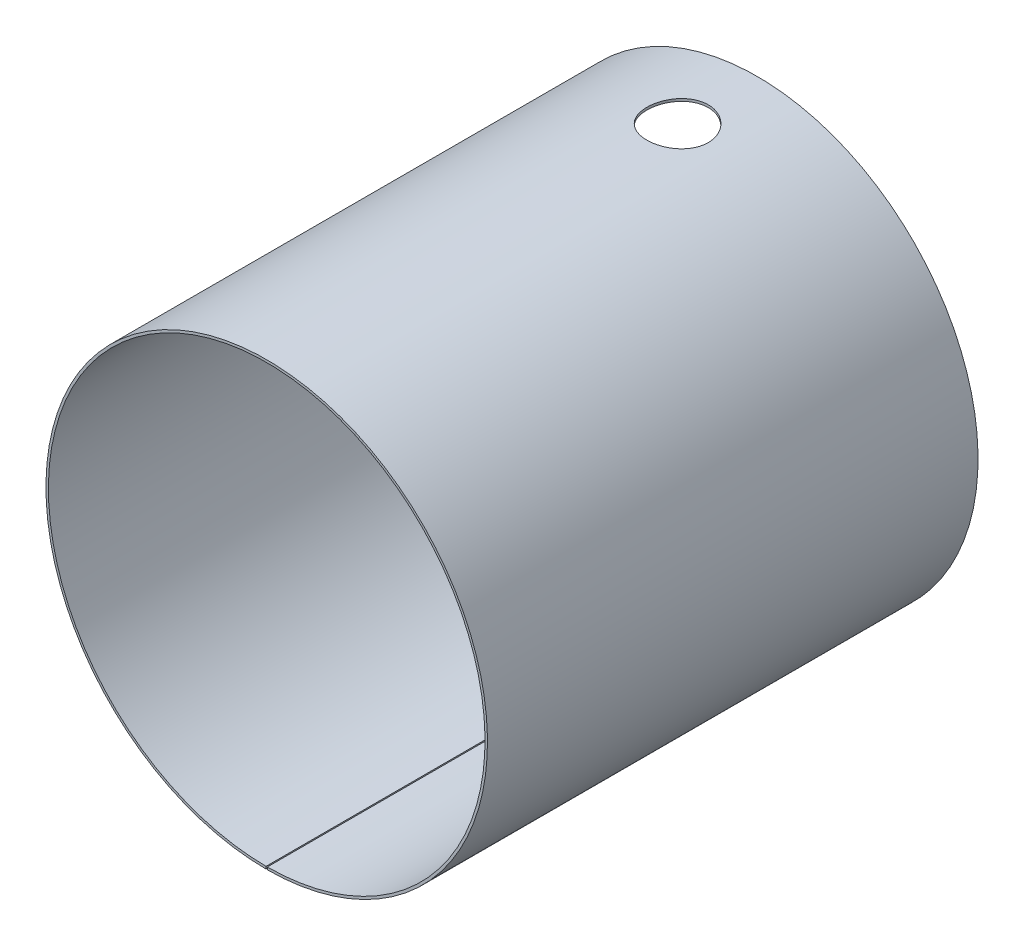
ISO-10303-21;
HEADER;
FILE_DESCRIPTION(('STEP AP214'),'2;1');
FILE_NAME('part.step','',(''),(''),'','','');
FILE_SCHEMA(('AUTOMOTIVE_DESIGN { 1 0 10303 214 1 1 1 1 }'));
ENDSEC;
DATA;
#1=APPLICATION_CONTEXT('core data for automotive mechanical design processes');
#2=APPLICATION_PROTOCOL_DEFINITION('international standard','automotive_design',2000,#1);
#3=PRODUCT_CONTEXT('',#1,'mechanical');
#4=PRODUCT('Part','Part','',(#3));
#5=PRODUCT_RELATED_PRODUCT_CATEGORY('part','',(#4));
#6=PRODUCT_DEFINITION_FORMATION('','',#4);
#7=PRODUCT_DEFINITION_CONTEXT('part definition',#1,'design');
#8=PRODUCT_DEFINITION('design','',#6,#7);
#9=PRODUCT_DEFINITION_SHAPE('','',#8);
#10=(LENGTH_UNIT() NAMED_UNIT(*) SI_UNIT(.MILLI.,.METRE.));
#11=(NAMED_UNIT(*) PLANE_ANGLE_UNIT() SI_UNIT($,.RADIAN.));
#12=(NAMED_UNIT(*) SI_UNIT($,.STERADIAN.) SOLID_ANGLE_UNIT());
#13=UNCERTAINTY_MEASURE_WITH_UNIT(LENGTH_MEASURE(1.E-05),#10,'distance_accuracy_value','');
#14=(GEOMETRIC_REPRESENTATION_CONTEXT(3) GLOBAL_UNCERTAINTY_ASSIGNED_CONTEXT((#13)) GLOBAL_UNIT_ASSIGNED_CONTEXT((#10,
#11,#12)) REPRESENTATION_CONTEXT('',''));
#15=CARTESIAN_POINT('',(0.,0.,0.));
#16=DIRECTION('',(0.,0.,1.));
#17=DIRECTION('',(1.,0.,0.));
#18=AXIS2_PLACEMENT_3D('',#15,#16,#17);
#19=CARTESIAN_POINT('',(0.,0.,400.));
#20=DIRECTION('',(0.,0.,-1.));
#21=DIRECTION('',(-1.,0.,0.));
#22=AXIS2_PLACEMENT_3D('',#19,#20,#21);
#23=CYLINDRICAL_SURFACE('',#22,180.);
#24=CARTESIAN_POINT('',(0.,0.,0.));
#25=DIRECTION('',(0.,0.,1.));
#26=DIRECTION('',(1.,0.,0.));
#27=AXIS2_PLACEMENT_3D('',#24,#25,#26);
#28=CIRCLE('',#27,180.);
#29=CARTESIAN_POINT('',(0.500000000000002,-179.999305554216,0.));
#30=VERTEX_POINT('',#29);
#31=CARTESIAN_POINT('',(-0.500000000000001,-179.999305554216,0.));
#32=VERTEX_POINT('',#31);
#33=EDGE_CURVE('E97',#30,#32,#28,.T.);
#34=ORIENTED_EDGE('',*,*,#33,.T.);
#35=DIRECTION('',(0.,0.,-1.));
#36=VECTOR('',#35,1.);
#37=CARTESIAN_POINT('',(-0.499999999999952,-179.999305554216,400.));
#38=LINE('',#37,#36);
#39=CARTESIAN_POINT('',(-0.499999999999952,-179.999305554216,400.));
#40=VERTEX_POINT('',#39);
#41=EDGE_CURVE('E69',#32,#40,#38,.F.);
#42=ORIENTED_EDGE('',*,*,#41,.T.);
#43=CARTESIAN_POINT('',(0.,0.,400.));
#44=DIRECTION('',(0.,0.,1.));
#45=DIRECTION('',(1.,0.,0.));
#46=AXIS2_PLACEMENT_3D('',#43,#44,#45);
#47=CIRCLE('',#46,180.);
#48=CARTESIAN_POINT('',(0.500000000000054,-179.999305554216,400.));
#49=VERTEX_POINT('',#48);
#50=EDGE_CURVE('E92',#49,#40,#47,.T.);
#51=ORIENTED_EDGE('',*,*,#50,.F.);
#52=DIRECTION('',(0.,0.,-1.));
#53=VECTOR('',#52,1.);
#54=CARTESIAN_POINT('',(0.500000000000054,-179.999305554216,400.));
#55=LINE('',#54,#53);
#56=EDGE_CURVE('E85',#49,#30,#55,.T.);
#57=ORIENTED_EDGE('',*,*,#56,.T.);
#58=EDGE_LOOP('',(#34,#42,#51,#57));
#59=FACE_BOUND('',#58,.T.);
#60=CARTESIAN_POINT('',(0.,180.,40.));
#61=CARTESIAN_POINT('',(-0.69876775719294,180.000003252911,39.9999911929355));
#62=CARTESIAN_POINT('',(-1.39740938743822,179.995923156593,40.0293066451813));
#63=CARTESIAN_POINT('',(-2.78990965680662,179.979723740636,40.1463382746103));
#64=CARTESIAN_POINT('',(-3.48376721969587,179.967602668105,40.2340671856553));
#65=CARTESIAN_POINT('',(-4.8621408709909,179.935642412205,40.4673951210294));
#66=CARTESIAN_POINT('',(-5.54664776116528,179.915796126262,40.6130474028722));
#67=CARTESIAN_POINT('',(-6.90078477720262,179.868947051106,40.9611183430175));
#68=CARTESIAN_POINT('',(-7.57041570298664,179.84194464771,41.1635339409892));
#69=CARTESIAN_POINT('',(-8.88964283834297,179.781561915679,41.6234755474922));
#70=CARTESIAN_POINT('',(-9.53925284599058,179.74818609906,41.8809625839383));
#71=CARTESIAN_POINT('',(-10.8144050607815,179.675976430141,42.4492595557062));
#72=CARTESIAN_POINT('',(-11.4399469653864,179.63714250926,42.7600701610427));
#73=CARTESIAN_POINT('',(-12.6625194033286,179.555105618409,43.4327259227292));
#74=CARTESIAN_POINT('',(-13.2595547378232,179.511903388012,43.794562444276));
#75=CARTESIAN_POINT('',(-14.421123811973,179.42232461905,44.5667531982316));
#76=CARTESIAN_POINT('',(-14.9856574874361,179.375948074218,44.9771075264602));
#77=CARTESIAN_POINT('',(-16.0816542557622,179.28102195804,45.8460860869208));
#78=CARTESIAN_POINT('',(-16.6128975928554,179.232460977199,46.3049862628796));
#79=CARTESIAN_POINT('',(-17.634903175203,179.134792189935,47.2657927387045));
#80=CARTESIAN_POINT('',(-18.1256652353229,179.085684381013,47.7676992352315));
#81=CARTESIAN_POINT('',(-19.0633238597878,178.988301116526,48.8110636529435));
#82=CARTESIAN_POINT('',(-19.5102180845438,178.940025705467,49.352523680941));
#83=CARTESIAN_POINT('',(-20.3569839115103,178.845673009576,50.4712239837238));
#84=CARTESIAN_POINT('',(-20.7568554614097,178.79959572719,51.0484642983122));
#85=CARTESIAN_POINT('',(-21.5083244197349,178.710760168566,52.2372215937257));
#86=CARTESIAN_POINT('',(-21.859711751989,178.668016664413,52.8488725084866));
#87=CARTESIAN_POINT('',(-22.5096715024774,178.587295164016,54.09992731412));
#88=CARTESIAN_POINT('',(-22.8082437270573,178.549317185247,54.7393313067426));
#89=CARTESIAN_POINT('',(-23.3503679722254,178.479228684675,56.041340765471));
#90=CARTESIAN_POINT('',(-23.5939219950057,178.447117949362,56.7039453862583));
#91=CARTESIAN_POINT('',(-24.0242040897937,178.389699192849,58.0476426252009));
#92=CARTESIAN_POINT('',(-24.2109325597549,178.36439112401,58.7287351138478));
#93=CARTESIAN_POINT('',(-24.5251366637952,178.321458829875,60.1000708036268));
#94=CARTESIAN_POINT('',(-24.6529859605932,178.303786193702,60.7902268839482));
#95=CARTESIAN_POINT('',(-24.8502282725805,178.276403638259,62.1789992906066));
#96=CARTESIAN_POINT('',(-24.9196215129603,178.266693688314,62.8776155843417));
#97=CARTESIAN_POINT('',(-24.9994216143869,178.25552039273,64.2782442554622));
#98=CARTESIAN_POINT('',(-25.0098310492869,178.254056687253,64.9802564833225));
#99=CARTESIAN_POINT('',(-24.9715907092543,178.259417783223,66.382637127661));
#100=CARTESIAN_POINT('',(-24.9229411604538,178.266242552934,67.0830055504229));
#101=CARTESIAN_POINT('',(-24.7675089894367,178.287903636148,68.4720991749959));
#102=CARTESIAN_POINT('',(-24.6611411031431,178.302682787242,69.1608717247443));
#103=CARTESIAN_POINT('',(-24.3913447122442,178.339790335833,70.5269368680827));
#104=CARTESIAN_POINT('',(-24.2279165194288,178.362118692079,71.2042295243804));
#105=CARTESIAN_POINT('',(-23.8452057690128,178.413686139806,72.5425851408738));
#106=CARTESIAN_POINT('',(-23.6259222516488,178.442925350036,73.2036478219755));
#107=CARTESIAN_POINT('',(-23.1331033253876,178.5074823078,74.5049243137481));
#108=CARTESIAN_POINT('',(-22.8595676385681,178.542800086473,75.1451380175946));
#109=CARTESIAN_POINT('',(-22.259197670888,178.61864382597,76.4024145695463));
#110=CARTESIAN_POINT('',(-21.9321861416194,178.659187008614,77.019391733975));
#111=CARTESIAN_POINT('',(-21.2278574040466,178.744241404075,78.2236398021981));
#112=CARTESIAN_POINT('',(-20.8505401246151,178.788752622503,78.8109106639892));
#113=CARTESIAN_POINT('',(-20.0482326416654,178.880494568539,79.9517454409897));
#114=CARTESIAN_POINT('',(-19.6232401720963,178.927725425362,80.5053077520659));
#115=CARTESIAN_POINT('',(-18.728546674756,179.023584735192,81.574911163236));
#116=CARTESIAN_POINT('',(-18.2588453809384,179.072213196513,82.090952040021));
#117=CARTESIAN_POINT('',(-17.2737612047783,179.16993101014,83.0862267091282));
#118=CARTESIAN_POINT('',(-16.758021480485,179.219020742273,83.5651073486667));
#119=CARTESIAN_POINT('',(-15.6879407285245,179.315858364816,84.4777571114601));
#120=CARTESIAN_POINT('',(-15.1335994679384,179.363606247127,84.9115259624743));
#121=CARTESIAN_POINT('',(-13.9901695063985,179.456412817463,85.7308912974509));
#122=CARTESIAN_POINT('',(-13.4010805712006,179.501471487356,86.1164874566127));
#123=CARTESIAN_POINT('',(-12.1922707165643,179.587626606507,86.8367472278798));
#124=CARTESIAN_POINT('',(-11.5725498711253,179.628723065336,87.171410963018));
#125=CARTESIAN_POINT('',(-10.3065241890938,179.705809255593,87.7875271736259));
#126=CARTESIAN_POINT('',(-9.66020687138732,179.741796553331,88.0689543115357));
#127=CARTESIAN_POINT('',(-8.34584147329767,179.807618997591,88.5763265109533));
#128=CARTESIAN_POINT('',(-7.67779336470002,179.837454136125,88.8022715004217));
#129=CARTESIAN_POINT('',(-6.32477444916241,179.89012069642,89.1969794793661));
#130=CARTESIAN_POINT('',(-5.63980444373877,179.912952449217,89.3657451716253));
#131=CARTESIAN_POINT('',(-4.25785107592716,179.950961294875,89.6448293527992));
#132=CARTESIAN_POINT('',(-3.56086780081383,179.966138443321,89.7551482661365));
#133=CARTESIAN_POINT('',(-2.16570841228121,179.988311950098,89.9158327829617));
#134=CARTESIAN_POINT('',(-1.46758923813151,179.995374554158,89.9666839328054));
#135=CARTESIAN_POINT('',(-0.0695122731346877,180.00134392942,90.0096836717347));
#136=CARTESIAN_POINT('',(0.630445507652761,180.000250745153,90.0018325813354));
#137=CARTESIAN_POINT('',(2.02716062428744,179.989939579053,89.927488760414));
#138=CARTESIAN_POINT('',(2.72391804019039,179.980721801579,89.8609975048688));
#139=CARTESIAN_POINT('',(4.10926142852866,179.954421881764,89.6698783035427));
#140=CARTESIAN_POINT('',(4.79784740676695,179.937339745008,89.5452503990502));
#141=CARTESIAN_POINT('',(6.15913296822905,179.895877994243,89.2394253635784));
#142=CARTESIAN_POINT('',(6.83188623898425,179.871528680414,89.0584629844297));
#143=CARTESIAN_POINT('',(8.15969958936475,179.816186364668,88.6411424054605));
#144=CARTESIAN_POINT('',(8.81475973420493,179.785193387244,88.4047844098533));
#145=CARTESIAN_POINT('',(10.1026520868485,179.717423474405,87.8783824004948));
#146=CARTESIAN_POINT('',(10.7354835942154,179.680646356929,87.5883366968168));
#147=CARTESIAN_POINT('',(11.9745359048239,179.602327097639,86.9566407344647));
#148=CARTESIAN_POINT('',(12.5807565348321,179.560784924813,86.6149901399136));
#149=CARTESIAN_POINT('',(13.766158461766,179.47380962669,85.8801871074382));
#150=CARTESIAN_POINT('',(14.3451454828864,179.428353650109,85.4867239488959));
#151=CARTESIAN_POINT('',(15.4679780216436,179.335047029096,84.6527537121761));
#152=CARTESIAN_POINT('',(16.0118234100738,179.287196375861,84.2122464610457));
#153=CARTESIAN_POINT('',(17.0606547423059,179.190433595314,83.2872360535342));
#154=CARTESIAN_POINT('',(17.5656389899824,179.141521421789,82.8027309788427));
#155=CARTESIAN_POINT('',(18.5332430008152,179.044004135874,81.7930884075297));
#156=CARTESIAN_POINT('',(18.9958625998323,178.995399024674,81.2679507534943));
#157=CARTESIAN_POINT('',(19.8786513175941,178.899518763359,80.1767974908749));
#158=CARTESIAN_POINT('',(20.2984961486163,178.852255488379,79.6105184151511));
#159=CARTESIAN_POINT('',(21.0889848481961,178.760770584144,78.4443638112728));
#160=CARTESIAN_POINT('',(21.4596284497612,178.716548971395,77.8444881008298));
#161=CARTESIAN_POINT('',(22.1490415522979,178.632417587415,76.6153545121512));
#162=CARTESIAN_POINT('',(22.467811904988,178.59250774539,75.9860971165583));
#163=CARTESIAN_POINT('',(23.0511565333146,178.518152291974,74.7026319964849));
#164=CARTESIAN_POINT('',(23.3157310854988,178.483706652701,74.0484243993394));
#165=CARTESIAN_POINT('',(23.7879819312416,178.421379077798,72.7217939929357));
#166=CARTESIAN_POINT('',(23.9958338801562,178.393476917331,72.0494346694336));
#167=CARTESIAN_POINT('',(24.3541773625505,178.344909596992,70.6893412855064));
#168=CARTESIAN_POINT('',(24.5046689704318,178.324244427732,70.0016072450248));
#169=CARTESIAN_POINT('',(24.7471454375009,178.290756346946,68.6157460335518));
#170=CARTESIAN_POINT('',(24.8391331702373,178.277933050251,67.917619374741));
#171=CARTESIAN_POINT('',(24.9639095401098,178.260503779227,66.5159950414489));
#172=CARTESIAN_POINT('',(24.9966985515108,178.255897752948,65.812497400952));
#173=CARTESIAN_POINT('',(25.0028009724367,178.255041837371,64.4112967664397));
#174=CARTESIAN_POINT('',(24.9766235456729,178.258720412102,63.7135959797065));
#175=CARTESIAN_POINT('',(24.8660367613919,178.274180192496,62.3229189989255));
#176=CARTESIAN_POINT('',(24.7816277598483,178.285961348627,61.6299427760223));
#177=CARTESIAN_POINT('',(24.5552134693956,178.317286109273,60.25364807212));
#178=CARTESIAN_POINT('',(24.4132084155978,178.336829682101,59.5703295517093));
#179=CARTESIAN_POINT('',(24.0726606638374,178.383117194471,58.2181799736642));
#180=CARTESIAN_POINT('',(23.8741178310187,178.409861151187,57.5493489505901));
#181=CARTESIAN_POINT('',(23.4220847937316,178.469767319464,56.231242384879));
#182=CARTESIAN_POINT('',(23.168625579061,178.502925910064,55.5819560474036));
#183=CARTESIAN_POINT('',(22.6085330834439,178.574729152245,54.3070582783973));
#184=CARTESIAN_POINT('',(22.3018998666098,178.613373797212,53.6814468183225));
#185=CARTESIAN_POINT('',(21.6376437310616,178.695059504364,52.4581988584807));
#186=CARTESIAN_POINT('',(21.2800200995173,178.738100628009,51.8605627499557));
#187=CARTESIAN_POINT('',(20.5163006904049,178.827372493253,50.6973606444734));
#188=CARTESIAN_POINT('',(20.1102046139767,178.873603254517,50.1317948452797));
#189=CARTESIAN_POINT('',(19.2488165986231,178.968355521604,49.0320659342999));
#190=CARTESIAN_POINT('',(18.7931464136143,179.016892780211,48.4982004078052));
#191=CARTESIAN_POINT('',(17.8385739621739,179.114531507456,47.4706805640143));
#192=CARTESIAN_POINT('',(17.3396713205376,179.163632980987,46.977026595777));
#193=CARTESIAN_POINT('',(16.3019724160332,179.261031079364,46.0332477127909));
#194=CARTESIAN_POINT('',(15.7631666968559,179.309327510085,45.5831331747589));
#195=CARTESIAN_POINT('',(14.6495039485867,179.403746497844,44.7297220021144));
#196=CARTESIAN_POINT('',(14.0746473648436,179.449869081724,44.3264247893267));
#197=CARTESIAN_POINT('',(12.8900888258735,179.53885359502,43.5677203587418));
#198=CARTESIAN_POINT('',(12.2802362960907,179.58169924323,43.212546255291));
#199=CARTESIAN_POINT('',(11.0324120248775,179.662675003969,42.5548817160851));
#200=CARTESIAN_POINT('',(10.3944386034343,179.700804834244,42.2523944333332));
#201=CARTESIAN_POINT('',(9.09553523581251,179.771225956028,41.702617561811));
#202=CARTESIAN_POINT('',(8.43462819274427,179.803522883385,41.4552746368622));
#203=CARTESIAN_POINT('',(7.0942256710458,179.861397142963,41.0173154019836));
#204=CARTESIAN_POINT('',(6.41473449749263,179.886976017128,40.8266860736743));
#205=CARTESIAN_POINT('',(4.79097719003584,179.938668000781,40.4444928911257));
#206=CARTESIAN_POINT('',(3.84059809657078,179.961567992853,40.2779873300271));
#207=CARTESIAN_POINT('',(1.92673269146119,179.992231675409,40.0557475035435));
#208=CARTESIAN_POINT('',(0.963246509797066,179.999995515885,40.0000121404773));
#209=CARTESIAN_POINT('',(0.,180.,40.));
#210=B_SPLINE_CURVE_WITH_KNOTS('',3,(#60,#61,#62,#63,#64,#65,#66,#67,#68,#69,#70,#71,#72,#73,
#74,#75,#76,#77,#78,#79,#80,#81,#82,#83,#84,#85,#86,#87,#88,#89,#90,#91,#92,#93,#94,#95,#96,#97,
#98,#99,#100,#101,#102,#103,#104,#105,#106,#107,#108,#109,#110,#111,#112,#113,#114,#115,#116,
#117,#118,#119,#120,#121,#122,#123,#124,#125,#126,#127,#128,#129,#130,#131,#132,#133,#134,#135,
#136,#137,#138,#139,#140,#141,#142,#143,#144,#145,#146,#147,#148,#149,#150,#151,#152,#153,#154,
#155,#156,#157,#158,#159,#160,#161,#162,#163,#164,#165,#166,#167,#168,#169,#170,#171,#172,#173,
#174,#175,#176,#177,#178,#179,#180,#181,#182,#183,#184,#185,#186,#187,#188,#189,#190,#191,#192,
#193,#194,#195,#196,#197,#198,#199,#200,#201,#202,#203,#204,#205,#206,#207,#208,#209),
.UNSPECIFIED.,.T.,.F.,(4,2,2,2,2,2,2,2,2,2,2,2,2,2,2,2,2,2,2,2,2,2,2,2,2,2,2,2,2,2,2,2,2,2,2,2,
2,2,2,2,2,2,2,2,2,2,2,2,2,2,2,2,2,2,2,2,2,2,2,2,2,2,2,2,2,2,2,2,2,2,2,2,2,2,4),(0.,
2.09545991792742,4.19137678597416,6.28922521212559,8.38696055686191,10.4832162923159,
12.5794983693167,14.6754261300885,16.7713580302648,18.8799185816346,20.9884887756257,
23.0971713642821,25.2058562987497,27.3234087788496,29.440969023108,31.558452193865,
33.6759205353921,35.779759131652,37.8835896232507,39.9873283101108,42.0910589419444,
44.1798695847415,46.2686688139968,48.3575039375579,50.4463497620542,52.5422649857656,
54.6381831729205,56.7342010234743,58.8302313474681,60.9442161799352,63.0582137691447,
65.1722256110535,67.286232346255,69.4012427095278,71.516255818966,73.6311689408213,
75.7460667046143,77.843573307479,79.9410684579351,82.0385108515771,84.1359517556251,
86.2247668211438,88.3135741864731,90.4024473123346,92.4913340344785,94.5933727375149,
96.6954191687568,98.7975572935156,100.899703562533,103.016756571,105.133821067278,
107.250850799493,109.367869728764,111.478256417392,113.588640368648,115.698920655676,
117.80918760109,119.901302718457,121.99340504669,124.085498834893,126.177597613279,
128.268518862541,130.359437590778,132.450385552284,134.541346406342,136.649558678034,
138.75778924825,140.866521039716,142.975226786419,145.093807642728,147.212515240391,
149.32916462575,151.445327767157,154.333933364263,157.222510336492),.UNSPECIFIED.);
#211=CARTESIAN_POINT('',(0.,180.,40.));
#212=VERTEX_POINT('',#211);
#213=EDGE_CURVE('E122',#212,#212,#210,.T.);
#214=ORIENTED_EDGE('',*,*,#213,.F.);
#215=EDGE_LOOP('',(#214));
#216=FACE_BOUND('',#215,.T.);
#217=ADVANCED_FACE('F45',(#59,#216),#23,.T.);
#218=CARTESIAN_POINT('',(0.,0.,400.));
#219=DIRECTION('',(0.,0.,-1.));
#220=DIRECTION('',(-1.,0.,0.));
#221=AXIS2_PLACEMENT_3D('',#218,#219,#220);
#222=CYLINDRICAL_SURFACE('',#221,178.);
#223=DIRECTION('',(0.,0.,-1.));
#224=VECTOR('',#223,1.);
#225=CARTESIAN_POINT('',(-0.499999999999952,-177.999297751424,400.));
#226=LINE('',#225,#224);
#227=CARTESIAN_POINT('',(-0.500000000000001,-177.999297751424,0.));
#228=VERTEX_POINT('',#227);
#229=CARTESIAN_POINT('',(-0.499999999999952,-177.999297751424,400.));
#230=VERTEX_POINT('',#229);
#231=EDGE_CURVE('E148',#228,#230,#226,.F.);
#232=ORIENTED_EDGE('',*,*,#231,.F.);
#233=CARTESIAN_POINT('',(0.,0.,0.));
#234=DIRECTION('',(0.,0.,1.));
#235=DIRECTION('',(1.,0.,0.));
#236=AXIS2_PLACEMENT_3D('',#233,#234,#235);
#237=CIRCLE('',#236,178.);
#238=CARTESIAN_POINT('',(0.500000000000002,-177.999297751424,0.));
#239=VERTEX_POINT('',#238);
#240=EDGE_CURVE('E110',#239,#228,#237,.T.);
#241=ORIENTED_EDGE('',*,*,#240,.F.);
#242=DIRECTION('',(0.,0.,-1.));
#243=VECTOR('',#242,1.);
#244=CARTESIAN_POINT('',(0.500000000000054,-177.999297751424,400.));
#245=LINE('',#244,#243);
#246=CARTESIAN_POINT('',(0.500000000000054,-177.999297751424,400.));
#247=VERTEX_POINT('',#246);
#248=EDGE_CURVE('E61',#247,#239,#245,.T.);
#249=ORIENTED_EDGE('',*,*,#248,.F.);
#250=CARTESIAN_POINT('',(0.,0.,400.));
#251=DIRECTION('',(0.,0.,1.));
#252=DIRECTION('',(1.,0.,0.));
#253=AXIS2_PLACEMENT_3D('',#250,#251,#252);
#254=CIRCLE('',#253,178.);
#255=EDGE_CURVE('E104',#247,#230,#254,.T.);
#256=ORIENTED_EDGE('',*,*,#255,.T.);
#257=EDGE_LOOP('',(#232,#241,#249,#256));
#258=FACE_BOUND('',#257,.T.);
#259=CARTESIAN_POINT('',(0.,178.,40.));
#260=CARTESIAN_POINT('',(-0.69868666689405,178.000003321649,39.9999910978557));
#261=CARTESIAN_POINT('',(-1.39724621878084,177.995878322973,40.0292997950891));
#262=CARTESIAN_POINT('',(-2.78958176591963,177.97950070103,40.1463038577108));
#263=CARTESIAN_POINT('',(-3.48335669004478,177.967246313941,40.2340118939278));
#264=CARTESIAN_POINT('',(-4.86156158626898,177.934934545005,40.4672828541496));
#265=CARTESIAN_POINT('',(-5.54598240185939,177.914870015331,40.612898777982));
#266=CARTESIAN_POINT('',(-6.89994795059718,177.867505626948,40.9608808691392));
#267=CARTESIAN_POINT('',(-7.5694934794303,177.840206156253,41.1632439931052));
#268=CARTESIAN_POINT('',(-8.88854818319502,177.779158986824,41.6230623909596));
#269=CARTESIAN_POINT('',(-9.53807126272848,177.745415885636,41.8804784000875));
#270=CARTESIAN_POINT('',(-10.8130541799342,177.672411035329,42.448615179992));
#271=CARTESIAN_POINT('',(-11.4385137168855,177.633149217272,42.7593366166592));
#272=CARTESIAN_POINT('',(-12.6609303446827,177.550207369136,43.4317967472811));
#273=CARTESIAN_POINT('',(-13.2578921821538,177.506528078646,43.7935269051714));
#274=CARTESIAN_POINT('',(-14.4193255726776,177.415958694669,44.5654882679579));
#275=CARTESIAN_POINT('',(-14.9837970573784,177.369068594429,44.9757195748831));
#276=CARTESIAN_POINT('',(-16.0797558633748,177.273083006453,45.8444935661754));
#277=CARTESIAN_POINT('',(-16.6110187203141,177.223975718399,46.3033181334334));
#278=CARTESIAN_POINT('',(-17.6330710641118,177.125205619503,47.2639724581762));
#279=CARTESIAN_POINT('',(-18.1238603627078,177.075542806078,47.7658024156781));
#280=CARTESIAN_POINT('',(-19.0615830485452,176.977056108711,48.8090154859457));
#281=CARTESIAN_POINT('',(-19.5085140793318,176.928232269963,49.3504007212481));
#282=CARTESIAN_POINT('',(-20.3553638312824,176.832804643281,50.4689558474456));
#283=CARTESIAN_POINT('',(-20.7552824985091,176.786200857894,51.0461257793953));
#284=CARTESIAN_POINT('',(-21.5068936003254,176.696342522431,52.2348083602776));
#285=CARTESIAN_POINT('',(-21.8583710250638,176.653103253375,52.8464581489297));
#286=CARTESIAN_POINT('',(-22.5085098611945,176.571442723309,54.09752570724));
#287=CARTESIAN_POINT('',(-22.8071710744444,176.533021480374,54.7369435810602));
#288=CARTESIAN_POINT('',(-23.3494697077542,176.462112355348,56.038995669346));
#289=CARTESIAN_POINT('',(-23.5931091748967,176.429624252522,56.7016290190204));
#290=CARTESIAN_POINT('',(-24.0235562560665,176.371528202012,58.0453983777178));
#291=CARTESIAN_POINT('',(-24.2103642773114,176.345920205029,58.7265342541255));
#292=CARTESIAN_POINT('',(-24.5246960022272,176.302479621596,60.0978708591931));
#293=CARTESIAN_POINT('',(-24.6526017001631,176.284596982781,60.7879824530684));
#294=CARTESIAN_POINT('',(-24.8499633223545,176.256884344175,62.1766741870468));
#295=CARTESIAN_POINT('',(-24.919419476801,176.24705431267,62.8752542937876));
#296=CARTESIAN_POINT('',(-24.9993505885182,176.235734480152,64.275816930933));
#297=CARTESIAN_POINT('',(-25.0098281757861,176.234244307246,64.977799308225));
#298=CARTESIAN_POINT('',(-24.9717288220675,176.239646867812,66.3801256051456));
#299=CARTESIAN_POINT('',(-24.923152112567,176.246539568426,67.080469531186));
#300=CARTESIAN_POINT('',(-24.7678826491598,176.268426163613,68.4694034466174));
#301=CARTESIAN_POINT('',(-24.6616141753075,176.283360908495,69.1580418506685));
#302=CARTESIAN_POINT('',(-24.3920406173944,176.320863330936,70.5238459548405));
#303=CARTESIAN_POINT('',(-24.228735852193,176.343430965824,71.2010117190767));
#304=CARTESIAN_POINT('',(-23.8462960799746,176.395553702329,72.5391230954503));
#305=CARTESIAN_POINT('',(-23.6271600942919,176.425108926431,73.2000684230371));
#306=CARTESIAN_POINT('',(-23.1346602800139,176.490365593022,74.5011223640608));
#307=CARTESIAN_POINT('',(-22.8612961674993,176.526067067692,75.1412308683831));
#308=CARTESIAN_POINT('',(-22.2612712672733,176.602739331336,76.398358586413));
#309=CARTESIAN_POINT('',(-21.934429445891,176.643727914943,77.0152903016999));
#310=CARTESIAN_POINT('',(-21.2304549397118,176.729718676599,78.2194626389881));
#311=CARTESIAN_POINT('',(-20.853322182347,176.774720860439,78.8067032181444));
#312=CARTESIAN_POINT('',(-20.0513961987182,176.867476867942,79.9474967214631));
#313=CARTESIAN_POINT('',(-19.6266006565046,176.91523082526,80.5010480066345));
#314=CARTESIAN_POINT('',(-18.7323108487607,177.012154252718,81.5706514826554));
#315=CARTESIAN_POINT('',(-18.2628163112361,177.061323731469,82.086703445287));
#316=CARTESIAN_POINT('',(-17.2780572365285,177.16014135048,83.0821228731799));
#317=CARTESIAN_POINT('',(-16.7624277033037,177.209789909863,83.5611292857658));
#318=CARTESIAN_POINT('',(-15.6925545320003,177.307733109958,84.4740403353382));
#319=CARTESIAN_POINT('',(-15.1383106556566,177.356027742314,84.9079446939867));
#320=CARTESIAN_POINT('',(-13.9950599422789,177.449900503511,85.7275904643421));
#321=CARTESIAN_POINT('',(-13.406052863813,177.495478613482,86.1133315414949));
#322=CARTESIAN_POINT('',(-12.1973889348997,177.582630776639,86.8338891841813));
#323=CARTESIAN_POINT('',(-11.5777321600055,177.624204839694,87.1687058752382));
#324=CARTESIAN_POINT('',(-10.3118042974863,177.702191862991,87.7851392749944));
#325=CARTESIAN_POINT('',(-9.66552027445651,177.738602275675,88.0667297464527));
#326=CARTESIAN_POINT('',(-8.35120021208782,177.805203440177,88.5744300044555));
#327=CARTESIAN_POINT('',(-7.68316414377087,177.835394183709,88.8005397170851));
#328=CARTESIAN_POINT('',(-6.33014922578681,177.888694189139,89.1955752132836));
#329=CARTESIAN_POINT('',(-5.64517119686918,177.911803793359,89.3645037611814));
#330=CARTESIAN_POINT('',(-4.26318259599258,177.95028259,89.6439090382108));
#331=CARTESIAN_POINT('',(-3.56617211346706,177.965651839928,89.7543862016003));
#332=CARTESIAN_POINT('',(-2.17106986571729,177.988114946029,89.9153640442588));
#333=CARTESIAN_POINT('',(-1.4730364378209,177.995277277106,89.9663610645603));
#334=CARTESIAN_POINT('',(-0.0751173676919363,178.001356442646,90.0096653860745));
#335=CARTESIAN_POINT('',(0.624768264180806,178.000273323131,90.0019730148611));
#336=CARTESIAN_POINT('',(2.02135172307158,177.989892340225,89.9279583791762));
#337=CARTESIAN_POINT('',(2.71804963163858,177.980594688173,89.8616376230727));
#338=CARTESIAN_POINT('',(4.10328657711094,177.954047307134,89.6708706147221));
#339=CARTESIAN_POINT('',(4.79182561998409,177.936797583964,89.5464244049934));
#340=CARTESIAN_POINT('',(6.15296295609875,177.894920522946,89.2409880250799));
#341=CARTESIAN_POINT('',(6.82561616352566,177.870324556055,89.060238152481));
#342=CARTESIAN_POINT('',(8.15324628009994,177.814414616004,88.6433642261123));
#343=CARTESIAN_POINT('',(8.80822325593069,177.783100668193,88.4072403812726));
#344=CARTESIAN_POINT('',(10.0959692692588,177.714622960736,87.8813273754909));
#345=CARTESIAN_POINT('',(10.7287375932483,177.677459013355,87.5915364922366));
#346=CARTESIAN_POINT('',(11.9676864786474,177.598310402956,86.9603695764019));
#347=CARTESIAN_POINT('',(12.5738668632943,177.556325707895,86.6189932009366));
#348=CARTESIAN_POINT('',(13.7592938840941,177.468412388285,85.8847085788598));
#349=CARTESIAN_POINT('',(14.3383422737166,177.422460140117,85.4914830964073));
#350=CARTESIAN_POINT('',(15.4613186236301,177.328128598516,84.6579902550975));
#351=CARTESIAN_POINT('',(16.0052464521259,177.279749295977,84.2177227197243));
#352=CARTESIAN_POINT('',(17.0542665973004,177.181910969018,83.2931903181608));
#353=CARTESIAN_POINT('',(17.5593571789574,177.132451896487,82.8089234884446));
#354=CARTESIAN_POINT('',(18.527199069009,177.033837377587,81.7997525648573));
#355=CARTESIAN_POINT('',(18.989950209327,176.984681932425,81.2748483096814));
#356=CARTESIAN_POINT('',(19.8731026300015,176.887700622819,80.1840637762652));
#357=CARTESIAN_POINT('',(20.2931721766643,176.839886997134,79.6179137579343));
#358=CARTESIAN_POINT('',(21.084120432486,176.74732948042,78.4519928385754));
#359=CARTESIAN_POINT('',(21.454998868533,176.702585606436,77.8522217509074));
#360=CARTESIAN_POINT('',(22.1448894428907,176.61745308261,76.6232708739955));
#361=CARTESIAN_POINT('',(22.4639024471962,176.577064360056,75.994091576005));
#362=CARTESIAN_POINT('',(23.0477372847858,176.501808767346,74.7107544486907));
#363=CARTESIAN_POINT('',(23.3125594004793,176.466941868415,74.0565967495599));
#364=CARTESIAN_POINT('',(23.7852922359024,176.403845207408,72.7300758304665));
#365=CARTESIAN_POINT('',(23.993381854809,176.375594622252,72.0577773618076));
#366=CARTESIAN_POINT('',(24.3522050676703,176.32641022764,70.6977792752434));
#367=CARTESIAN_POINT('',(24.5029387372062,176.305476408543,70.0100796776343));
#368=CARTESIAN_POINT('',(24.7459001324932,176.271539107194,68.6242627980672));
#369=CARTESIAN_POINT('',(24.8381308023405,176.258535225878,67.9261460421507));
#370=CARTESIAN_POINT('',(24.9633911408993,176.240838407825,66.5245181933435));
#371=CARTESIAN_POINT('',(24.9964211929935,176.236145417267,65.8210071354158));
#372=CARTESIAN_POINT('',(25.0029988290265,176.235212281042,64.419898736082));
#373=CARTESIAN_POINT('',(24.9770672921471,176.238898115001,63.7223038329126));
#374=CARTESIAN_POINT('',(24.8669900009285,176.254463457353,62.33181824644));
#375=CARTESIAN_POINT('',(24.7828446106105,176.26634291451,61.638927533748));
#376=CARTESIAN_POINT('',(24.5569741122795,176.297952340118,60.262783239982));
#377=CARTESIAN_POINT('',(24.4152492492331,176.317682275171,59.5795296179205));
#378=CARTESIAN_POINT('',(24.0752775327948,176.364425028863,58.2274882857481));
#379=CARTESIAN_POINT('',(23.8770305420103,176.391437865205,57.5587006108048));
#380=CARTESIAN_POINT('',(23.425609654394,176.451955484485,56.2406749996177));
#381=CARTESIAN_POINT('',(23.1724681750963,176.485456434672,55.5914257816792));
#382=CARTESIAN_POINT('',(22.6130273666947,176.558008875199,54.3165758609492));
#383=CARTESIAN_POINT('',(22.3067281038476,176.597060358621,53.6909751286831));
#384=CARTESIAN_POINT('',(21.643153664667,176.67961293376,52.4677184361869));
#385=CARTESIAN_POINT('',(21.2858777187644,176.723114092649,51.8700628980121));
#386=CARTESIAN_POINT('',(20.5228647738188,176.813346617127,50.7067890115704));
#387=CARTESIAN_POINT('',(20.1171274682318,176.860078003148,50.1411708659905));
#388=CARTESIAN_POINT('',(19.2563870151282,176.955871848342,49.041197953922));
#389=CARTESIAN_POINT('',(18.8009970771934,177.004950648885,48.5071472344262));
#390=CARTESIAN_POINT('',(17.8469720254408,177.103685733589,47.4792325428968));
#391=CARTESIAN_POINT('',(17.3483365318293,177.153342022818,46.9853689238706));
#392=CARTESIAN_POINT('',(16.3111552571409,177.25184785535,46.0411458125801));
#393=CARTESIAN_POINT('',(15.7726000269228,177.30069720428,45.5907966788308));
#394=CARTESIAN_POINT('',(14.6594172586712,177.396204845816,44.7368915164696));
#395=CARTESIAN_POINT('',(14.0847901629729,177.442863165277,44.3333349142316));
#396=CARTESIAN_POINT('',(12.9006022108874,177.532894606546,43.5740456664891));
#397=CARTESIAN_POINT('',(12.2908871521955,177.576250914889,43.2185514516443));
#398=CARTESIAN_POINT('',(11.043303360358,177.65820061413,42.5602369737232));
#399=CARTESIAN_POINT('',(10.405432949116,177.696793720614,42.2574198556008));
#400=CARTESIAN_POINT('',(9.10669732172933,177.768080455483,41.7069768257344));
#401=CARTESIAN_POINT('',(8.44585496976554,177.800779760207,41.4592977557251));
#402=CARTESIAN_POINT('',(7.10554553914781,177.859386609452,41.0206649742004));
#403=CARTESIAN_POINT('',(6.42608275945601,177.885295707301,40.8296982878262));
#404=CARTESIAN_POINT('',(4.80055539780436,177.937729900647,40.4462878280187));
#405=CARTESIAN_POINT('',(3.84831112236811,177.960979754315,40.2791108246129));
#406=CARTESIAN_POINT('',(1.93063028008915,177.992112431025,40.0559736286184));
#407=CARTESIAN_POINT('',(0.965193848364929,177.999995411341,40.0000122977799));
#408=CARTESIAN_POINT('',(0.,178.,40.));
#409=B_SPLINE_CURVE_WITH_KNOTS('',3,(#259,#260,#261,#262,#263,#264,#265,#266,#267,#268,#269,
#270,#271,#272,#273,#274,#275,#276,#277,#278,#279,#280,#281,#282,#283,#284,#285,#286,#287,#288,
#289,#290,#291,#292,#293,#294,#295,#296,#297,#298,#299,#300,#301,#302,#303,#304,#305,#306,#307,
#308,#309,#310,#311,#312,#313,#314,#315,#316,#317,#318,#319,#320,#321,#322,#323,#324,#325,#326,
#327,#328,#329,#330,#331,#332,#333,#334,#335,#336,#337,#338,#339,#340,#341,#342,#343,#344,#345,
#346,#347,#348,#349,#350,#351,#352,#353,#354,#355,#356,#357,#358,#359,#360,#361,#362,#363,#364,
#365,#366,#367,#368,#369,#370,#371,#372,#373,#374,#375,#376,#377,#378,#379,#380,#381,#382,#383,
#384,#385,#386,#387,#388,#389,#390,#391,#392,#393,#394,#395,#396,#397,#398,#399,#400,#401,#402,
#403,#404,#405,#406,#407,#408),.UNSPECIFIED.,.T.,.F.,(4,2,2,2,2,2,2,2,2,2,2,2,2,2,2,2,2,2,2,2,2,
2,2,2,2,2,2,2,2,2,2,2,2,2,2,2,2,2,2,2,2,2,2,2,2,2,2,2,2,2,2,2,2,2,2,2,2,2,2,2,2,2,2,2,2,2,2,2,2,
2,2,2,2,2,4),(0.,2.09521489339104,4.19088453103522,6.28847664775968,8.38595629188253,
10.4819449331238,12.5779597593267,14.673624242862,16.7692931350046,18.8778641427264,
20.9864449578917,23.0951390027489,25.2038354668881,27.321609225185,29.4393909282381,
31.5570938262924,33.6747815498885,35.7785352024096,37.8822805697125,39.9859321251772,
42.0895754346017,44.1779535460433,46.266319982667,48.3547230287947,50.4431370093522,
52.5387728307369,54.6344116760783,56.7301523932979,58.8259058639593,60.9400225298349,
63.0541522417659,65.1682966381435,67.2824358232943,69.3976144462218,71.5127958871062,
73.6278750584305,75.7429385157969,77.8402232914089,79.9374963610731,82.0347154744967,
84.1319330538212,86.2203198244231,88.3086987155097,90.3971446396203,92.4856044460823,
94.5874930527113,96.6893895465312,98.7913798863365,100.893378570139,103.010632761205,
105.1278987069,107.245129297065,109.362348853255,111.472812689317,113.583273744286,
115.693628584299,117.803969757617,119.89574023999,121.987497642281,124.079246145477,
126.170999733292,128.2615213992,130.352040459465,132.442591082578,134.533154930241,
136.641357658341,138.749578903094,140.858300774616,142.966996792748,145.08579732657,
147.204724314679,149.321599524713,151.437990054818,154.332433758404,157.226847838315),.UNSPECIFIED.);
#410=CARTESIAN_POINT('',(0.,178.,40.));
#411=VERTEX_POINT('',#410);
#412=EDGE_CURVE('E114',#411,#411,#409,.T.);
#413=ORIENTED_EDGE('',*,*,#412,.T.);
#414=EDGE_LOOP('',(#413));
#415=FACE_BOUND('',#414,.T.);
#416=ADVANCED_FACE('F124',(#258,#415),#222,.F.);
#417=CARTESIAN_POINT('',(0.,0.,400.));
#418=DIRECTION('',(0.,0.,1.));
#419=DIRECTION('',(1.,0.,0.));
#420=AXIS2_PLACEMENT_3D('',#417,#418,#419);
#421=PLANE('',#420);
#422=DIRECTION('',(0.,-1.,0.));
#423=VECTOR('',#422,1.);
#424=CARTESIAN_POINT('',(-0.499999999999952,0.,400.));
#425=LINE('',#424,#423);
#426=EDGE_CURVE('E123',#230,#40,#425,.T.);
#427=ORIENTED_EDGE('',*,*,#426,.F.);
#428=ORIENTED_EDGE('',*,*,#255,.F.);
#429=DIRECTION('',(0.,1.,0.));
#430=VECTOR('',#429,1.);
#431=CARTESIAN_POINT('',(0.500000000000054,0.,400.));
#432=LINE('',#431,#430);
#433=EDGE_CURVE('E100',#49,#247,#432,.T.);
#434=ORIENTED_EDGE('',*,*,#433,.F.);
#435=ORIENTED_EDGE('',*,*,#50,.T.);
#436=EDGE_LOOP('',(#427,#428,#434,#435));
#437=FACE_BOUND('',#436,.T.);
#438=ADVANCED_FACE('F158',(#437),#421,.T.);
#439=CARTESIAN_POINT('',(0.,0.,0.));
#440=DIRECTION('',(0.,0.,1.));
#441=DIRECTION('',(1.,0.,0.));
#442=AXIS2_PLACEMENT_3D('',#439,#440,#441);
#443=PLANE('',#442);
#444=ORIENTED_EDGE('',*,*,#240,.T.);
#445=DIRECTION('',(0.,-1.,0.));
#446=VECTOR('',#445,1.);
#447=CARTESIAN_POINT('',(-0.500000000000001,0.,0.));
#448=LINE('',#447,#446);
#449=EDGE_CURVE('E12',#228,#32,#448,.T.);
#450=ORIENTED_EDGE('',*,*,#449,.T.);
#451=ORIENTED_EDGE('',*,*,#33,.F.);
#452=DIRECTION('',(0.,1.,0.));
#453=VECTOR('',#452,1.);
#454=CARTESIAN_POINT('',(0.500000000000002,0.,0.));
#455=LINE('',#454,#453);
#456=EDGE_CURVE('E54',#30,#239,#455,.T.);
#457=ORIENTED_EDGE('',*,*,#456,.T.);
#458=EDGE_LOOP('',(#444,#450,#451,#457));
#459=FACE_BOUND('',#458,.T.);
#460=ADVANCED_FACE('F102',(#459),#443,.F.);
#461=CARTESIAN_POINT('',(0.,271.,65.));
#462=DIRECTION('',(0.,-1.,0.));
#463=DIRECTION('',(0.,0.,-1.));
#464=AXIS2_PLACEMENT_3D('',#461,#462,#463);
#465=CYLINDRICAL_SURFACE('',#464,25.);
#466=ORIENTED_EDGE('',*,*,#412,.F.);
#467=EDGE_LOOP('',(#466));
#468=FACE_BOUND('',#467,.T.);
#469=ORIENTED_EDGE('',*,*,#213,.T.);
#470=EDGE_LOOP('',(#469));
#471=FACE_BOUND('',#470,.T.);
#472=ADVANCED_FACE('F127',(#468,#471),#465,.F.);
#473=CARTESIAN_POINT('',(0.5,-180.,-10.3737032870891));
#474=DIRECTION('',(1.,0.,0.));
#475=DIRECTION('',(0.,0.,-1.));
#476=AXIS2_PLACEMENT_3D('',#473,#474,#475);
#477=PLANE('',#476);
#478=ORIENTED_EDGE('',*,*,#433,.T.);
#479=ORIENTED_EDGE('',*,*,#248,.T.);
#480=ORIENTED_EDGE('',*,*,#456,.F.);
#481=ORIENTED_EDGE('',*,*,#56,.F.);
#482=EDGE_LOOP('',(#478,#479,#480,#481));
#483=FACE_BOUND('',#482,.T.);
#484=ADVANCED_FACE('F84',(#483),#477,.F.);
#485=CARTESIAN_POINT('',(-0.500000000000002,-180.,-10.3737032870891));
#486=DIRECTION('',(-1.,0.,0.));
#487=DIRECTION('',(0.,0.,1.));
#488=AXIS2_PLACEMENT_3D('',#485,#486,#487);
#489=PLANE('',#488);
#490=ORIENTED_EDGE('',*,*,#426,.T.);
#491=ORIENTED_EDGE('',*,*,#41,.F.);
#492=ORIENTED_EDGE('',*,*,#449,.F.);
#493=ORIENTED_EDGE('',*,*,#231,.T.);
#494=EDGE_LOOP('',(#490,#491,#492,#493));
#495=FACE_BOUND('',#494,.T.);
#496=ADVANCED_FACE('F132',(#495),#489,.F.);
#497=CLOSED_SHELL('',(#217,#416,#438,#460,#472,#484,#496));
#498=MANIFOLD_SOLID_BREP('B2',#497);
#499=ADVANCED_BREP_SHAPE_REPRESENTATION('',(#18,#498),#14);
#500=SHAPE_DEFINITION_REPRESENTATION(#9,#499);
ENDSEC;
END-ISO-10303-21;
